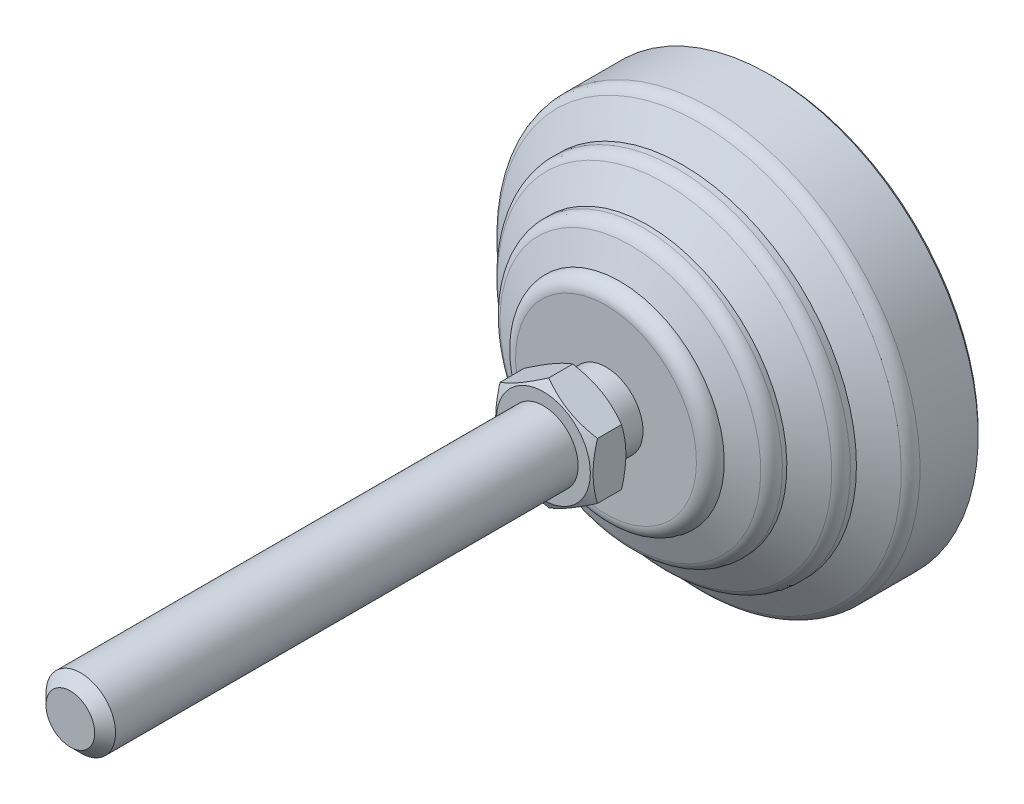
ISO-10303-21;
HEADER;
FILE_DESCRIPTION(('STEP AP214'),'2;1');
FILE_NAME('part.step','',(''),(''),'','','');
FILE_SCHEMA(('AUTOMOTIVE_DESIGN { 1 0 10303 214 1 1 1 1 }'));
ENDSEC;
DATA;
#1=APPLICATION_CONTEXT('core data for automotive mechanical design processes');
#2=APPLICATION_PROTOCOL_DEFINITION('international standard','automotive_design',2000,#1);
#3=PRODUCT_CONTEXT('',#1,'mechanical');
#4=PRODUCT('Part','Part','',(#3));
#5=PRODUCT_RELATED_PRODUCT_CATEGORY('part','',(#4));
#6=PRODUCT_DEFINITION_FORMATION('','',#4);
#7=PRODUCT_DEFINITION_CONTEXT('part definition',#1,'design');
#8=PRODUCT_DEFINITION('design','',#6,#7);
#9=PRODUCT_DEFINITION_SHAPE('','',#8);
#10=(LENGTH_UNIT() NAMED_UNIT(*) SI_UNIT(.MILLI.,.METRE.));
#11=(NAMED_UNIT(*) PLANE_ANGLE_UNIT() SI_UNIT($,.RADIAN.));
#12=(NAMED_UNIT(*) SI_UNIT($,.STERADIAN.) SOLID_ANGLE_UNIT());
#13=UNCERTAINTY_MEASURE_WITH_UNIT(LENGTH_MEASURE(1.E-05),#10,'distance_accuracy_value','');
#14=(GEOMETRIC_REPRESENTATION_CONTEXT(3) GLOBAL_UNCERTAINTY_ASSIGNED_CONTEXT((#13)) GLOBAL_UNIT_ASSIGNED_CONTEXT((#10,
#11,#12)) REPRESENTATION_CONTEXT('',''));
#15=CARTESIAN_POINT('',(0.,0.,0.));
#16=DIRECTION('',(0.,0.,1.));
#17=DIRECTION('',(1.,0.,0.));
#18=AXIS2_PLACEMENT_3D('',#15,#16,#17);
#19=CARTESIAN_POINT('',(-29.5,0.,0.));
#20=DIRECTION('',(0.,0.,1.));
#21=DIRECTION('',(0.,-1.,0.));
#22=AXIS2_PLACEMENT_3D('',#19,#20,#21);
#23=PLANE('',#22);
#24=CARTESIAN_POINT('',(0.,0.,0.));
#25=DIRECTION('',(0.,0.,-1.));
#26=DIRECTION('',(0.,1.,0.));
#27=AXIS2_PLACEMENT_3D('',#24,#25,#26);
#28=CIRCLE('',#27,29.5);
#29=CARTESIAN_POINT('',(0.,29.5,0.));
#30=VERTEX_POINT('',#29);
#31=EDGE_CURVE('E95',#30,#30,#28,.T.);
#32=ORIENTED_EDGE('',*,*,#31,.T.);
#33=EDGE_LOOP('',(#32));
#34=FACE_BOUND('',#33,.T.);
#35=ADVANCED_FACE('F14',(#34),#23,.F.);
#36=CARTESIAN_POINT('',(-5.32445501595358,0.,28.));
#37=DIRECTION('',(0.,0.,1.));
#38=DIRECTION('',(0.,-1.,0.));
#39=AXIS2_PLACEMENT_3D('',#36,#37,#38);
#40=PLANE('',#39);
#41=CARTESIAN_POINT('',(0.,0.,28.));
#42=DIRECTION('',(0.,0.,1.));
#43=DIRECTION('',(1.,0.,0.));
#44=AXIS2_PLACEMENT_3D('',#41,#42,#43);
#45=CIRCLE('',#44,6.75);
#46=CARTESIAN_POINT('',(6.75,0.,28.));
#47=VERTEX_POINT('',#46);
#48=EDGE_CURVE('E542',#47,#47,#45,.T.);
#49=ORIENTED_EDGE('',*,*,#48,.F.);
#50=EDGE_LOOP('',(#49));
#51=FACE_BOUND('',#50,.T.);
#52=CARTESIAN_POINT('',(0.,0.,28.));
#53=DIRECTION('',(0.,0.,-1.));
#54=DIRECTION('',(0.,1.,0.));
#55=AXIS2_PLACEMENT_3D('',#52,#53,#54);
#56=CIRCLE('',#55,5.32445501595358);
#57=CARTESIAN_POINT('',(0.,5.32445501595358,28.));
#58=VERTEX_POINT('',#57);
#59=EDGE_CURVE('E74',#58,#58,#56,.T.);
#60=ORIENTED_EDGE('',*,*,#59,.F.);
#61=EDGE_LOOP('',(#60));
#62=FACE_BOUND('',#61,.T.);
#63=ADVANCED_FACE('F270',(#51,#62),#40,.F.);
#64=CARTESIAN_POINT('',(0.,0.,0.));
#65=DIRECTION('',(0.,0.,-1.));
#66=DIRECTION('',(0.,1.,0.));
#67=AXIS2_PLACEMENT_3D('',#64,#65,#66);
#68=CYLINDRICAL_SURFACE('',#67,5.32445501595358);
#69=CARTESIAN_POINT('',(0.,0.,24.));
#70=DIRECTION('',(0.,0.,-1.));
#71=DIRECTION('',(0.,1.,0.));
#72=AXIS2_PLACEMENT_3D('',#69,#70,#71);
#73=CIRCLE('',#72,5.32445501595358);
#74=CARTESIAN_POINT('',(0.,5.32445501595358,24.));
#75=VERTEX_POINT('',#74);
#76=EDGE_CURVE('E131',#75,#75,#73,.T.);
#77=ORIENTED_EDGE('',*,*,#76,.F.);
#78=EDGE_LOOP('',(#77));
#79=FACE_BOUND('',#78,.T.);
#80=ORIENTED_EDGE('',*,*,#59,.T.);
#81=EDGE_LOOP('',(#80));
#82=FACE_BOUND('',#81,.T.);
#83=ADVANCED_FACE('F266',(#79,#82),#68,.T.);
#84=CARTESIAN_POINT('',(-13.,0.,24.));
#85=DIRECTION('',(0.,0.,-1.));
#86=DIRECTION('',(0.,1.,0.));
#87=AXIS2_PLACEMENT_3D('',#84,#85,#86);
#88=PLANE('',#87);
#89=CARTESIAN_POINT('',(0.,0.,24.));
#90=DIRECTION('',(0.,0.,-1.));
#91=DIRECTION('',(0.,1.,0.));
#92=AXIS2_PLACEMENT_3D('',#89,#90,#91);
#93=CIRCLE('',#92,13.);
#94=CARTESIAN_POINT('',(0.,13.,24.));
#95=VERTEX_POINT('',#94);
#96=EDGE_CURVE('E128',#95,#95,#93,.T.);
#97=ORIENTED_EDGE('',*,*,#96,.F.);
#98=EDGE_LOOP('',(#97));
#99=FACE_BOUND('',#98,.T.);
#100=ORIENTED_EDGE('',*,*,#76,.T.);
#101=EDGE_LOOP('',(#100));
#102=FACE_BOUND('',#101,.T.);
#103=ADVANCED_FACE('F262',(#99,#102),#88,.F.);
#104=CARTESIAN_POINT('',(0.,0.,22.));
#105=DIRECTION('',(0.,0.,-1.));
#106=DIRECTION('',(0.,1.,0.));
#107=AXIS2_PLACEMENT_3D('',#104,#105,#106);
#108=TOROIDAL_SURFACE('',#107,13.,2.);
#109=CARTESIAN_POINT('',(0.,0.,22.));
#110=DIRECTION('',(0.,0.,-1.));
#111=DIRECTION('',(0.,1.,0.));
#112=AXIS2_PLACEMENT_3D('',#109,#110,#111);
#113=CIRCLE('',#112,15.);
#114=CARTESIAN_POINT('',(0.,15.,22.));
#115=VERTEX_POINT('',#114);
#116=EDGE_CURVE('E125',#115,#115,#113,.T.);
#117=ORIENTED_EDGE('',*,*,#116,.F.);
#118=EDGE_LOOP('',(#117));
#119=FACE_BOUND('',#118,.T.);
#120=ORIENTED_EDGE('',*,*,#96,.T.);
#121=EDGE_LOOP('',(#120));
#122=FACE_BOUND('',#121,.T.);
#123=ADVANCED_FACE('F258',(#119,#122),#108,.T.);
#124=CARTESIAN_POINT('',(0.,0.,22.));
#125=DIRECTION('',(0.,0.,-1.));
#126=DIRECTION('',(0.,1.,0.));
#127=AXIS2_PLACEMENT_3D('',#124,#125,#126);
#128=CONICAL_SURFACE('',#127,15.,1.19028994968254);
#129=CARTESIAN_POINT('',(0.,0.,20.5028874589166));
#130=DIRECTION('',(0.,0.,-1.));
#131=DIRECTION('',(0.,1.,0.));
#132=AXIS2_PLACEMENT_3D('',#129,#130,#131);
#133=CIRCLE('',#132,18.7427813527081);
#134=CARTESIAN_POINT('',(0.,18.7427813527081,20.5028874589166));
#135=VERTEX_POINT('',#134);
#136=EDGE_CURVE('E122',#135,#135,#133,.T.);
#137=ORIENTED_EDGE('',*,*,#136,.F.);
#138=EDGE_LOOP('',(#137));
#139=FACE_BOUND('',#138,.T.);
#140=ORIENTED_EDGE('',*,*,#116,.T.);
#141=EDGE_LOOP('',(#140));
#142=FACE_BOUND('',#141,.T.);
#143=ADVANCED_FACE('F254',(#139,#142),#128,.T.);
#144=CARTESIAN_POINT('',(0.,0.,18.6459340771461));
#145=DIRECTION('',(0.,0.,-1.));
#146=DIRECTION('',(0.,1.,0.));
#147=AXIS2_PLACEMENT_3D('',#144,#145,#146);
#148=TOROIDAL_SURFACE('',#147,18.,2.00000000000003);
#149=CARTESIAN_POINT('',(0.,0.,18.645934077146));
#150=DIRECTION('',(0.,0.,-1.));
#151=DIRECTION('',(0.,1.,0.));
#152=AXIS2_PLACEMENT_3D('',#149,#150,#151);
#153=CIRCLE('',#152,20.);
#154=CARTESIAN_POINT('',(0.,20.,18.645934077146));
#155=VERTEX_POINT('',#154);
#156=EDGE_CURVE('E119',#155,#155,#153,.T.);
#157=ORIENTED_EDGE('',*,*,#156,.F.);
#158=EDGE_LOOP('',(#157));
#159=FACE_BOUND('',#158,.T.);
#160=ORIENTED_EDGE('',*,*,#136,.T.);
#161=EDGE_LOOP('',(#160));
#162=FACE_BOUND('',#161,.T.);
#163=ADVANCED_FACE('F250',(#159,#162),#148,.T.);
#164=CARTESIAN_POINT('',(0.,0.,0.));
#165=DIRECTION('',(0.,0.,-1.));
#166=DIRECTION('',(0.,1.,0.));
#167=AXIS2_PLACEMENT_3D('',#164,#165,#166);
#168=CYLINDRICAL_SURFACE('',#167,20.);
#169=CARTESIAN_POINT('',(0.,0.,18.));
#170=DIRECTION('',(0.,0.,-1.));
#171=DIRECTION('',(0.,1.,0.));
#172=AXIS2_PLACEMENT_3D('',#169,#170,#171);
#173=CIRCLE('',#172,20.);
#174=CARTESIAN_POINT('',(0.,20.,18.));
#175=VERTEX_POINT('',#174);
#176=EDGE_CURVE('E116',#175,#175,#173,.T.);
#177=ORIENTED_EDGE('',*,*,#176,.F.);
#178=EDGE_LOOP('',(#177));
#179=FACE_BOUND('',#178,.T.);
#180=ORIENTED_EDGE('',*,*,#156,.T.);
#181=EDGE_LOOP('',(#180));
#182=FACE_BOUND('',#181,.T.);
#183=ADVANCED_FACE('F246',(#179,#182),#168,.T.);
#184=CARTESIAN_POINT('',(0.,0.,18.));
#185=DIRECTION('',(0.,0.,-1.));
#186=DIRECTION('',(0.,1.,0.));
#187=AXIS2_PLACEMENT_3D('',#184,#185,#186);
#188=CONICAL_SURFACE('',#187,20.,1.03037682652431);
#189=CARTESIAN_POINT('',(0.,0.,15.5826050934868));
#190=DIRECTION('',(0.,0.,-1.));
#191=DIRECTION('',(0.,1.,0.));
#192=AXIS2_PLACEMENT_3D('',#189,#190,#191);
#193=CIRCLE('',#192,24.0289915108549);
#194=CARTESIAN_POINT('',(0.,24.0289915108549,15.5826050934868));
#195=VERTEX_POINT('',#194);
#196=EDGE_CURVE('E113',#195,#195,#193,.T.);
#197=ORIENTED_EDGE('',*,*,#196,.F.);
#198=EDGE_LOOP('',(#197));
#199=FACE_BOUND('',#198,.T.);
#200=ORIENTED_EDGE('',*,*,#176,.T.);
#201=EDGE_LOOP('',(#200));
#202=FACE_BOUND('',#201,.T.);
#203=ADVANCED_FACE('F242',(#199,#202),#188,.T.);
#204=CARTESIAN_POINT('',(0.,0.,13.8676192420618));
#205=DIRECTION('',(0.,0.,-1.));
#206=DIRECTION('',(0.,1.,0.));
#207=AXIS2_PLACEMENT_3D('',#204,#205,#206);
#208=TOROIDAL_SURFACE('',#207,23.,2.00000000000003);
#209=CARTESIAN_POINT('',(0.,0.,13.8676192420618));
#210=DIRECTION('',(0.,0.,-1.));
#211=DIRECTION('',(0.,1.,0.));
#212=AXIS2_PLACEMENT_3D('',#209,#210,#211);
#213=CIRCLE('',#212,25.);
#214=CARTESIAN_POINT('',(0.,25.,13.8676192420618));
#215=VERTEX_POINT('',#214);
#216=EDGE_CURVE('E110',#215,#215,#213,.T.);
#217=ORIENTED_EDGE('',*,*,#216,.F.);
#218=EDGE_LOOP('',(#217));
#219=FACE_BOUND('',#218,.T.);
#220=ORIENTED_EDGE('',*,*,#196,.T.);
#221=EDGE_LOOP('',(#220));
#222=FACE_BOUND('',#221,.T.);
#223=ADVANCED_FACE('F238',(#219,#222),#208,.T.);
#224=CARTESIAN_POINT('',(0.,0.,0.));
#225=DIRECTION('',(0.,0.,-1.));
#226=DIRECTION('',(0.,1.,0.));
#227=AXIS2_PLACEMENT_3D('',#224,#225,#226);
#228=CYLINDRICAL_SURFACE('',#227,25.);
#229=CARTESIAN_POINT('',(0.,0.,13.));
#230=DIRECTION('',(0.,0.,-1.));
#231=DIRECTION('',(0.,1.,0.));
#232=AXIS2_PLACEMENT_3D('',#229,#230,#231);
#233=CIRCLE('',#232,25.);
#234=CARTESIAN_POINT('',(0.,25.,13.));
#235=VERTEX_POINT('',#234);
#236=EDGE_CURVE('E107',#235,#235,#233,.T.);
#237=ORIENTED_EDGE('',*,*,#236,.F.);
#238=EDGE_LOOP('',(#237));
#239=FACE_BOUND('',#238,.T.);
#240=ORIENTED_EDGE('',*,*,#216,.T.);
#241=EDGE_LOOP('',(#240));
#242=FACE_BOUND('',#241,.T.);
#243=ADVANCED_FACE('F234',(#239,#242),#228,.T.);
#244=CARTESIAN_POINT('',(0.,0.,13.));
#245=DIRECTION('',(0.,0.,-1.));
#246=DIRECTION('',(0.,1.,0.));
#247=AXIS2_PLACEMENT_3D('',#244,#245,#246);
#248=CONICAL_SURFACE('',#247,25.,1.03037682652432);
#249=CARTESIAN_POINT('',(0.,0.,10.5826050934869));
#250=DIRECTION('',(0.,0.,-1.));
#251=DIRECTION('',(0.,1.,0.));
#252=AXIS2_PLACEMENT_3D('',#249,#250,#251);
#253=CIRCLE('',#252,29.028991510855);
#254=CARTESIAN_POINT('',(0.,29.028991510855,10.5826050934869));
#255=VERTEX_POINT('',#254);
#256=EDGE_CURVE('E104',#255,#255,#253,.T.);
#257=ORIENTED_EDGE('',*,*,#256,.F.);
#258=EDGE_LOOP('',(#257));
#259=FACE_BOUND('',#258,.T.);
#260=ORIENTED_EDGE('',*,*,#236,.T.);
#261=EDGE_LOOP('',(#260));
#262=FACE_BOUND('',#261,.T.);
#263=ADVANCED_FACE('F230',(#259,#262),#248,.T.);
#264=CARTESIAN_POINT('',(0.,0.,8.86761924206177));
#265=DIRECTION('',(0.,0.,-1.));
#266=DIRECTION('',(0.,1.,0.));
#267=AXIS2_PLACEMENT_3D('',#264,#265,#266);
#268=TOROIDAL_SURFACE('',#267,28.,2.00000000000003);
#269=CARTESIAN_POINT('',(0.,0.,8.86761924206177));
#270=DIRECTION('',(0.,0.,-1.));
#271=DIRECTION('',(0.,1.,0.));
#272=AXIS2_PLACEMENT_3D('',#269,#270,#271);
#273=CIRCLE('',#272,30.);
#274=CARTESIAN_POINT('',(0.,30.,8.86761924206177));
#275=VERTEX_POINT('',#274);
#276=EDGE_CURVE('E101',#275,#275,#273,.T.);
#277=ORIENTED_EDGE('',*,*,#276,.F.);
#278=EDGE_LOOP('',(#277));
#279=FACE_BOUND('',#278,.T.);
#280=ORIENTED_EDGE('',*,*,#256,.T.);
#281=EDGE_LOOP('',(#280));
#282=FACE_BOUND('',#281,.T.);
#283=ADVANCED_FACE('F226',(#279,#282),#268,.T.);
#284=CARTESIAN_POINT('',(0.,0.,0.));
#285=DIRECTION('',(0.,0.,-1.));
#286=DIRECTION('',(0.,1.,0.));
#287=AXIS2_PLACEMENT_3D('',#284,#285,#286);
#288=CYLINDRICAL_SURFACE('',#287,30.);
#289=CARTESIAN_POINT('',(0.,0.,0.499999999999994));
#290=DIRECTION('',(0.,0.,-1.));
#291=DIRECTION('',(0.,1.,0.));
#292=AXIS2_PLACEMENT_3D('',#289,#290,#291);
#293=CIRCLE('',#292,30.);
#294=CARTESIAN_POINT('',(0.,30.,0.499999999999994));
#295=VERTEX_POINT('',#294);
#296=EDGE_CURVE('E98',#295,#295,#293,.T.);
#297=ORIENTED_EDGE('',*,*,#296,.F.);
#298=EDGE_LOOP('',(#297));
#299=FACE_BOUND('',#298,.T.);
#300=ORIENTED_EDGE('',*,*,#276,.T.);
#301=EDGE_LOOP('',(#300));
#302=FACE_BOUND('',#301,.T.);
#303=ADVANCED_FACE('F222',(#299,#302),#288,.T.);
#304=CARTESIAN_POINT('',(0.,0.,0.499999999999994));
#305=DIRECTION('',(0.,0.,1.));
#306=DIRECTION('',(0.,-1.,0.));
#307=AXIS2_PLACEMENT_3D('',#304,#305,#306);
#308=CONICAL_SURFACE('',#307,30.,0.785398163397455);
#309=ORIENTED_EDGE('',*,*,#31,.F.);
#310=EDGE_LOOP('',(#309));
#311=FACE_BOUND('',#310,.T.);
#312=ORIENTED_EDGE('',*,*,#296,.T.);
#313=EDGE_LOOP('',(#312));
#314=FACE_BOUND('',#313,.T.);
#315=ADVANCED_FACE('F150',(#311,#314),#308,.T.);
#316=CARTESIAN_POINT('',(0.,0.,28.));
#317=DIRECTION('',(0.,0.,1.));
#318=DIRECTION('',(1.,0.,0.));
#319=AXIS2_PLACEMENT_3D('',#316,#317,#318);
#320=CONICAL_SURFACE('',#319,6.75,1.0471975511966);
#321=CARTESIAN_POINT('',(0.000200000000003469,-8.0830192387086,28.7696190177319));
#322=CARTESIAN_POINT('',(-0.153667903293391,-7.99418356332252,28.7183374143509));
#323=CARTESIAN_POINT('',(-0.308109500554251,-7.90501666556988,28.669383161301));
#324=CARTESIAN_POINT('',(-0.618246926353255,-7.72595873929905,28.5767703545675));
#325=CARTESIAN_POINT('',(-0.773943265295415,-7.63606741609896,28.5331140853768));
#326=CARTESIAN_POINT('',(-1.24352516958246,-7.36495417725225,28.4109491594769));
#327=CARTESIAN_POINT('',(-1.5592643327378,-7.18266208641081,28.3414631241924));
#328=CARTESIAN_POINT('',(-2.03176224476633,-6.90986528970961,28.2599825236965));
#329=CARTESIAN_POINT('',(-2.18710922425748,-6.82017566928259,28.2367710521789));
#330=CARTESIAN_POINT('',(-2.49850511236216,-6.64039116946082,28.1978487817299));
#331=CARTESIAN_POINT('',(-2.6545539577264,-6.55029632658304,28.1821373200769));
#332=CARTESIAN_POINT('',(-2.96692267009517,-6.36995016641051,28.1586154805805));
#333=CARTESIAN_POINT('',(-3.12324202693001,-6.27969914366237,28.1507961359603));
#334=CARTESIAN_POINT('',(-3.43601650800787,-6.09911871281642,28.1432178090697));
#335=CARTESIAN_POINT('',(-3.59247162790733,-6.00878930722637,28.1434585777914));
#336=CARTESIAN_POINT('',(-4.02110687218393,-5.76131663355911,28.155197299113));
#337=CARTESIAN_POINT('',(-4.29314668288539,-5.60425437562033,28.1749033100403));
#338=CARTESIAN_POINT('',(-4.83541944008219,-5.29117305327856,28.2373910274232));
#339=CARTESIAN_POINT('',(-5.10565047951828,-5.13515508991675,28.2801940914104));
#340=CARTESIAN_POINT('',(-5.64901454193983,-4.82144370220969,28.3871892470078));
#341=CARTESIAN_POINT('',(-5.92207900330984,-4.6637898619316,28.4518346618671));
#342=CARTESIAN_POINT('',(-6.46413578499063,-4.35083323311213,28.5985536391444));
#343=CARTESIAN_POINT('',(-6.73313504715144,-4.19552643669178,28.680592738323));
#344=CARTESIAN_POINT('',(-7.0002,-4.04133641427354,28.7696190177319));
#345=B_SPLINE_CURVE_WITH_KNOTS('',3,(#321,#322,#323,#324,#325,#326,#327,#328,#329,#330,#331,
#332,#333,#334,#335,#336,#337,#338,#339,#340,#341,#342,#343,#344),.UNSPECIFIED.,.F.,.F.,(4,2,2,
2,2,2,2,2,2,2,2,4),(0.,0.554727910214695,1.10969417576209,2.2219327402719,2.76443041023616,
3.30688013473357,3.84871284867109,4.39052882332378,5.33376515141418,6.27787517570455,
7.2429241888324,8.20607866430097),.UNSPECIFIED.);
#346=CARTESIAN_POINT('',(0.,-8.08290376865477,28.7695523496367));
#347=VERTEX_POINT('',#346);
#348=CARTESIAN_POINT('',(-7.,-4.04145188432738,28.7695523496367));
#349=VERTEX_POINT('',#348);
#350=EDGE_CURVE('E69',#347,#349,#345,.T.);
#351=ORIENTED_EDGE('',*,*,#350,.T.);
#352=CARTESIAN_POINT('',(-7.,-10.8811850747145,31.5728296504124));
#353=CARTESIAN_POINT('',(-7.,-10.5752348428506,31.4243146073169));
#354=CARTESIAN_POINT('',(-7.,-10.2685850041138,31.2772162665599));
#355=CARTESIAN_POINT('',(-7.,-9.65351414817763,30.9866492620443));
#356=CARTESIAN_POINT('',(-7.,-9.34509286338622,30.8431811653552));
#357=CARTESIAN_POINT('',(-7.,-8.72453023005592,30.5599545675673));
#358=CARTESIAN_POINT('',(-7.,-8.41237778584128,30.4202202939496));
#359=CARTESIAN_POINT('',(-7.,-7.78559905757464,30.1464363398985));
#360=CARTESIAN_POINT('',(-7.,-7.47097289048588,30.0123863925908));
#361=CARTESIAN_POINT('',(-7.,-6.82849438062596,29.7472401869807));
#362=CARTESIAN_POINT('',(-7.,-6.50054387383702,29.6163804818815));
#363=CARTESIAN_POINT('',(-7.,-5.84081623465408,29.3645037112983));
#364=CARTESIAN_POINT('',(-7.,-5.50903867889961,29.2434877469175));
#365=CARTESIAN_POINT('',(-7.,-4.84173790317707,29.0144571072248));
#366=CARTESIAN_POINT('',(-7.,-4.50622373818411,28.9064163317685));
#367=CARTESIAN_POINT('',(-7.,-3.83039457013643,28.7067848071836));
#368=CARTESIAN_POINT('',(-7.,-3.49008110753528,28.6151889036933));
#369=CARTESIAN_POINT('',(-7.,-2.80629723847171,28.453320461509));
#370=CARTESIAN_POINT('',(-7.,-2.46285518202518,28.3829313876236));
#371=CARTESIAN_POINT('',(-7.,-1.94454397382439,28.296287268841));
#372=CARTESIAN_POINT('',(-7.,-1.77123615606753,28.2705612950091));
#373=CARTESIAN_POINT('',(-7.,-1.42375128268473,28.2259266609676));
#374=CARTESIAN_POINT('',(-7.,-1.2495743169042,28.2070173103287));
#375=CARTESIAN_POINT('',(-7.,-0.902870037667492,28.1766309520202));
#376=CARTESIAN_POINT('',(-7.,-0.730351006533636,28.1650598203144));
#377=CARTESIAN_POINT('',(-7.,-0.384978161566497,28.1492247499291));
#378=CARTESIAN_POINT('',(-7.,-0.21212435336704,28.1449606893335));
#379=CARTESIAN_POINT('',(-7.,0.133608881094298,28.1438415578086));
#380=CARTESIAN_POINT('',(-7.,0.306488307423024,28.1469865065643));
#381=CARTESIAN_POINT('',(-7.,0.6519602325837,28.1606081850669));
#382=CARTESIAN_POINT('',(-7.,0.824552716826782,28.1710852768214));
#383=CARTESIAN_POINT('',(-7.,1.23857301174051,28.2047901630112));
#384=CARTESIAN_POINT('',(-7.,1.47972707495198,28.2314539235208));
#385=CARTESIAN_POINT('',(-7.,1.96025069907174,28.2976470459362));
#386=CARTESIAN_POINT('',(-7.,2.19962001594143,28.3371781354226));
#387=CARTESIAN_POINT('',(-7.,2.91477396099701,28.4729767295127));
#388=CARTESIAN_POINT('',(-7.,3.38733962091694,28.5864251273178));
#389=CARTESIAN_POINT('',(-7.,4.09399085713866,28.783230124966));
#390=CARTESIAN_POINT('',(-7.,4.33173965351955,28.8541906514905));
#391=CARTESIAN_POINT('',(-7.,4.80492823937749,29.0035010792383));
#392=CARTESIAN_POINT('',(-7.,5.04036801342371,29.0818510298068));
#393=CARTESIAN_POINT('',(-7.,5.5090122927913,29.2446815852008));
#394=CARTESIAN_POINT('',(-7.,5.7422175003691,29.3291601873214));
#395=CARTESIAN_POINT('',(-7.,6.20669435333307,29.5032521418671));
#396=CARTESIAN_POINT('',(-7.,6.43796602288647,29.5928654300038));
#397=CARTESIAN_POINT('',(-7.,6.98976242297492,29.8126009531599));
#398=CARTESIAN_POINT('',(-7.,7.30947896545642,29.9447491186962));
#399=CARTESIAN_POINT('',(-7.,7.94614295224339,30.2155750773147));
#400=CARTESIAN_POINT('',(-7.,8.26309021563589,30.3542532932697));
#401=CARTESIAN_POINT('',(-7.,8.89473420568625,30.6368083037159));
#402=CARTESIAN_POINT('',(-7.,9.20943043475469,30.7806862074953));
#403=CARTESIAN_POINT('',(-7.,9.83689953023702,31.0725841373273));
#404=CARTESIAN_POINT('',(-7.,10.1496723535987,31.2206042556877));
#405=CARTESIAN_POINT('',(-7.,10.7739555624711,31.5201617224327));
#406=CARTESIAN_POINT('',(-7.,11.0854641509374,31.6717028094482));
#407=CARTESIAN_POINT('',(-7.,11.7071281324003,31.9775381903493));
#408=CARTESIAN_POINT('',(-7.,12.0172835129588,32.1318325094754));
#409=CARTESIAN_POINT('',(-7.,12.945960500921,32.5980598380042));
#410=CARTESIAN_POINT('',(-7.,13.5627813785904,32.9133800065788));
#411=CARTESIAN_POINT('',(-7.,14.740395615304,33.5230359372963));
#412=CARTESIAN_POINT('',(-7.,15.3014586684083,33.8168531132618));
#413=CARTESIAN_POINT('',(-7.,16.4215094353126,34.4084645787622));
#414=CARTESIAN_POINT('',(-7.,16.9804970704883,34.7062590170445));
#415=CARTESIAN_POINT('',(-7.,18.095415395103,35.3040962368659));
#416=CARTESIAN_POINT('',(-7.,18.651350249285,35.6041312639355));
#417=CARTESIAN_POINT('',(-7.,19.7618967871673,36.2065657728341));
#418=CARTESIAN_POINT('',(-7.,20.3165085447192,36.5089651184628));
#419=CARTESIAN_POINT('',(-7.,20.8706352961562,36.8122446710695));
#420=B_SPLINE_CURVE_WITH_KNOTS('',3,(#352,#353,#354,#355,#356,#357,#358,#359,#360,#361,#362,
#363,#364,#365,#366,#367,#368,#369,#370,#371,#372,#373,#374,#375,#376,#377,#378,#379,#380,#381,
#382,#383,#384,#385,#386,#387,#388,#389,#390,#391,#392,#393,#394,#395,#396,#397,#398,#399,#400,
#401,#402,#403,#404,#405,#406,#407,#408,#409,#410,#411,#412,#413,#414,#415,#416,#417,#418,#419),
.UNSPECIFIED.,.F.,.F.,(4,2,2,2,2,2,2,2,2,2,2,2,2,2,2,2,2,2,2,2,2,2,2,2,2,2,2,2,2,2,2,2,2,4),(0.,
1.02028698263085,2.04073236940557,3.06669051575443,4.09260044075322,5.15176160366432,
6.21104108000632,7.26815275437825,8.32493251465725,9.37579447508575,9.90130195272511,
10.4267561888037,10.945326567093,11.4638882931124,11.9824513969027,12.5010401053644,
13.2285005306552,13.956058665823,15.4119696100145,16.1562450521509,16.9005254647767,
17.6445637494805,18.3885927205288,19.4263457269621,20.4641660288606,21.5022090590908,
22.5402752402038,23.5794991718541,24.6187326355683,26.696904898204,28.5969096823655,
30.4969857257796,32.3921738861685,34.2872536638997),.UNSPECIFIED.);
#421=CARTESIAN_POINT('',(-7.,4.04145188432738,28.7695523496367));
#422=VERTEX_POINT('',#421);
#423=EDGE_CURVE('E80',#349,#422,#420,.T.);
#424=ORIENTED_EDGE('',*,*,#423,.T.);
#425=CARTESIAN_POINT('',(-7.0002,4.04133641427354,28.7696190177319));
#426=CARTESIAN_POINT('',(-6.84633209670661,4.13017208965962,28.7183374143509));
#427=CARTESIAN_POINT('',(-6.69189049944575,4.21933898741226,28.669383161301));
#428=CARTESIAN_POINT('',(-6.38175307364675,4.39839691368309,28.5767703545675));
#429=CARTESIAN_POINT('',(-6.22605673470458,4.48828823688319,28.5331140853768));
#430=CARTESIAN_POINT('',(-5.75647483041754,4.75940147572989,28.4109491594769));
#431=CARTESIAN_POINT('',(-5.4407356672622,4.94169356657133,28.3414631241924));
#432=CARTESIAN_POINT('',(-4.96823775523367,5.21449036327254,28.2599825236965));
#433=CARTESIAN_POINT('',(-4.81289077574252,5.30417998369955,28.2367710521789));
#434=CARTESIAN_POINT('',(-4.50149488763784,5.48396448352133,28.1978487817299));
#435=CARTESIAN_POINT('',(-4.34544604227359,5.57405932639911,28.1821373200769));
#436=CARTESIAN_POINT('',(-4.03307732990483,5.75440548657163,28.1586154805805));
#437=CARTESIAN_POINT('',(-3.87675797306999,5.84465650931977,28.1507961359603));
#438=CARTESIAN_POINT('',(-3.56398349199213,6.02523694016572,28.1432178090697));
#439=CARTESIAN_POINT('',(-3.40752837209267,6.11556634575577,28.1434585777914));
#440=CARTESIAN_POINT('',(-2.97889312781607,6.36303901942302,28.155197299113));
#441=CARTESIAN_POINT('',(-2.7068533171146,6.52010127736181,28.1749033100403));
#442=CARTESIAN_POINT('',(-2.16458055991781,6.83318259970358,28.2373910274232));
#443=CARTESIAN_POINT('',(-1.89434952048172,6.9892005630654,28.2801940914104));
#444=CARTESIAN_POINT('',(-1.35098545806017,7.30291195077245,28.3871892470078));
#445=CARTESIAN_POINT('',(-1.07792099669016,7.46056579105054,28.4518346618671));
#446=CARTESIAN_POINT('',(-0.535864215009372,7.77352241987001,28.5985536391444));
#447=CARTESIAN_POINT('',(-0.266864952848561,7.92882921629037,28.680592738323));
#448=CARTESIAN_POINT('',(0.000199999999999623,8.0830192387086,28.7696190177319));
#449=B_SPLINE_CURVE_WITH_KNOTS('',3,(#425,#426,#427,#428,#429,#430,#431,#432,#433,#434,#435,
#436,#437,#438,#439,#440,#441,#442,#443,#444,#445,#446,#447,#448),.UNSPECIFIED.,.F.,.F.,(4,2,2,
2,2,2,2,2,2,2,2,4),(0.,0.554727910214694,1.10969417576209,2.2219327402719,2.76443041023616,
3.30688013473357,3.84871284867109,4.39052882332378,5.33376515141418,6.27787517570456,
7.2429241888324,8.20607866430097),.UNSPECIFIED.);
#450=CARTESIAN_POINT('',(0.,8.08290376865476,28.7695523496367));
#451=VERTEX_POINT('',#450);
#452=EDGE_CURVE('E174',#422,#451,#449,.T.);
#453=ORIENTED_EDGE('',*,*,#452,.T.);
#454=CARTESIAN_POINT('',(-0.000200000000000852,8.0830192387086,28.7696190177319));
#455=CARTESIAN_POINT('',(0.15366790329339,7.99418356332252,28.7183374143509));
#456=CARTESIAN_POINT('',(0.308109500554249,7.90501666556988,28.669383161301));
#457=CARTESIAN_POINT('',(0.618246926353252,7.72595873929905,28.5767703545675));
#458=CARTESIAN_POINT('',(0.773943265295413,7.63606741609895,28.5331140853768));
#459=CARTESIAN_POINT('',(1.24352516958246,7.36495417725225,28.4109491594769));
#460=CARTESIAN_POINT('',(1.5592643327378,7.18266208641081,28.3414631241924));
#461=CARTESIAN_POINT('',(2.03176224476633,6.9098652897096,28.2599825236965));
#462=CARTESIAN_POINT('',(2.18710922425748,6.82017566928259,28.2367710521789));
#463=CARTESIAN_POINT('',(2.49850511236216,6.64039116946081,28.1978487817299));
#464=CARTESIAN_POINT('',(2.65455395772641,6.55029632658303,28.1821373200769));
#465=CARTESIAN_POINT('',(2.96692267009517,6.36995016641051,28.1586154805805));
#466=CARTESIAN_POINT('',(3.12324202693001,6.27969914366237,28.1507961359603));
#467=CARTESIAN_POINT('',(3.43601650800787,6.09911871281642,28.1432178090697));
#468=CARTESIAN_POINT('',(3.59247162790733,6.00878930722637,28.1434585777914));
#469=CARTESIAN_POINT('',(4.02110687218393,5.76131663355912,28.155197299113));
#470=CARTESIAN_POINT('',(4.2931466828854,5.60425437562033,28.1749033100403));
#471=CARTESIAN_POINT('',(4.83541944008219,5.29117305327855,28.2373910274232));
#472=CARTESIAN_POINT('',(5.10565047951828,5.13515508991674,28.2801940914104));
#473=CARTESIAN_POINT('',(5.64901454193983,4.82144370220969,28.3871892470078));
#474=CARTESIAN_POINT('',(5.92207900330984,4.66378986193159,28.4518346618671));
#475=CARTESIAN_POINT('',(6.46413578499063,4.35083323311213,28.5985536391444));
#476=CARTESIAN_POINT('',(6.73313504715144,4.19552643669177,28.680592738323));
#477=CARTESIAN_POINT('',(7.0002,4.04133641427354,28.7696190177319));
#478=B_SPLINE_CURVE_WITH_KNOTS('',3,(#454,#455,#456,#457,#458,#459,#460,#461,#462,#463,#464,
#465,#466,#467,#468,#469,#470,#471,#472,#473,#474,#475,#476,#477),.UNSPECIFIED.,.F.,.F.,(4,2,2,
2,2,2,2,2,2,2,2,4),(0.,0.554727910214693,1.10969417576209,2.2219327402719,2.76443041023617,
3.30688013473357,3.8487128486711,4.39052882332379,5.33376515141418,6.27787517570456,
7.2429241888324,8.20607866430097),.UNSPECIFIED.);
#479=CARTESIAN_POINT('',(7.,4.04145188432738,28.7695523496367));
#480=VERTEX_POINT('',#479);
#481=EDGE_CURVE('E167',#451,#480,#478,.T.);
#482=ORIENTED_EDGE('',*,*,#481,.T.);
#483=CARTESIAN_POINT('',(7.,-10.8811850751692,31.5728296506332));
#484=CARTESIAN_POINT('',(7.,-10.57523484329,31.4243146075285));
#485=CARTESIAN_POINT('',(7.,-10.268585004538,31.2772162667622));
#486=CARTESIAN_POINT('',(7.,-9.65351414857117,30.9866492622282));
#487=CARTESIAN_POINT('',(7.,-9.34509286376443,30.8431811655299));
#488=CARTESIAN_POINT('',(7.,-8.72453023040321,30.5599545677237));
#489=CARTESIAN_POINT('',(7.,-8.41237778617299,30.4202202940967));
#490=CARTESIAN_POINT('',(7.,-7.78559905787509,30.1464363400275));
#491=CARTESIAN_POINT('',(7.,-7.47097289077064,30.0123863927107));
#492=CARTESIAN_POINT('',(7.,-6.82849438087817,29.7472401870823));
#493=CARTESIAN_POINT('',(7.,-6.50054387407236,29.6163804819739));
#494=CARTESIAN_POINT('',(7.,-5.84081623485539,29.3645037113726));
#495=CARTESIAN_POINT('',(7.,-5.50903867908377,29.2434877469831));
#496=CARTESIAN_POINT('',(7.,-4.84173790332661,29.0144571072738));
#497=CARTESIAN_POINT('',(7.,-4.50622373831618,28.9064163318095));
#498=CARTESIAN_POINT('',(7.,-3.83039457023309,28.7067848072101));
#499=CARTESIAN_POINT('',(7.,-3.490081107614,28.6151889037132));
#500=CARTESIAN_POINT('',(7.,-2.80629723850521,28.4533204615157));
#501=CARTESIAN_POINT('',(7.,-2.46285518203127,28.3829313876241));
#502=CARTESIAN_POINT('',(7.,-1.9445439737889,28.2962872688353));
#503=CARTESIAN_POINT('',(7.,-1.7712361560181,28.270561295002));
#504=CARTESIAN_POINT('',(7.,-1.42375128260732,28.2259266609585));
#505=CARTESIAN_POINT('',(7.,-1.24957431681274,28.2070173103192));
#506=CARTESIAN_POINT('',(7.,-0.902870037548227,28.1766309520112));
#507=CARTESIAN_POINT('',(7.,-0.730351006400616,28.1650598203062));
#508=CARTESIAN_POINT('',(7.,-0.384978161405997,28.1492247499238));
#509=CARTESIAN_POINT('',(7.,-0.212124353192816,28.1449606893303));
#510=CARTESIAN_POINT('',(7.,0.133608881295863,28.1438415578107));
#511=CARTESIAN_POINT('',(7.,0.306488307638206,28.1469865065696));
#512=CARTESIAN_POINT('',(7.,0.651960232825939,28.1606081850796));
#513=CARTESIAN_POINT('',(7.,0.824552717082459,28.1710852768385));
#514=CARTESIAN_POINT('',(7.,1.23857301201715,28.2047901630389));
#515=CARTESIAN_POINT('',(7.,1.47972707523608,28.2314539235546));
#516=CARTESIAN_POINT('',(7.,1.96025069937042,28.2976470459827));
#517=CARTESIAN_POINT('',(7.,2.19962001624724,28.3371781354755));
#518=CARTESIAN_POINT('',(7.,2.91477396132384,28.4729767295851));
#519=CARTESIAN_POINT('',(7.,3.38733962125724,28.5864251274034));
#520=CARTESIAN_POINT('',(7.,4.09399085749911,28.783230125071));
#521=CARTESIAN_POINT('',(7.,4.33173965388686,28.8541906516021));
#522=CARTESIAN_POINT('',(7.,4.80492823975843,29.0035010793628));
#523=CARTESIAN_POINT('',(7.,5.04036801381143,29.0818510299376));
#524=CARTESIAN_POINT('',(7.,5.50901229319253,29.2446815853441));
#525=CARTESIAN_POINT('',(7.,5.74221750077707,29.3291601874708));
#526=CARTESIAN_POINT('',(7.,6.2066943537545,29.5032521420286));
#527=CARTESIAN_POINT('',(7.,6.43796602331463,29.5928654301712));
#528=CARTESIAN_POINT('',(7.,6.98976242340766,29.8126009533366));
#529=CARTESIAN_POINT('',(7.,7.30947896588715,29.9447491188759));
#530=CARTESIAN_POINT('',(7.,7.94614295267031,30.2155750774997));
#531=CARTESIAN_POINT('',(7.,8.26309021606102,30.3542532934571));
#532=CARTESIAN_POINT('',(7.,8.89473420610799,30.6368083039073));
#533=CARTESIAN_POINT('',(7.,9.20943043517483,30.7806862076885));
#534=CARTESIAN_POINT('',(7.,9.83689953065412,31.0725841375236));
#535=CARTESIAN_POINT('',(7.,10.1496723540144,31.2206042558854));
#536=CARTESIAN_POINT('',(7.,10.773955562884,31.5201617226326));
#537=CARTESIAN_POINT('',(7.,11.0854641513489,31.6717028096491));
#538=CARTESIAN_POINT('',(7.,11.7071281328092,31.977538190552));
#539=CARTESIAN_POINT('',(7.,12.0172835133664,32.1318325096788));
#540=CARTESIAN_POINT('',(7.,12.9459605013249,32.5980598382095));
#541=CARTESIAN_POINT('',(7.,13.5627813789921,32.9133800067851));
#542=CARTESIAN_POINT('',(7.,14.7403956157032,33.5230359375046));
#543=CARTESIAN_POINT('',(7.,15.3014586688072,33.8168531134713));
#544=CARTESIAN_POINT('',(7.,16.421509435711,34.4084645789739));
#545=CARTESIAN_POINT('',(7.,16.9804970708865,34.7062590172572));
#546=CARTESIAN_POINT('',(7.,18.0954153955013,35.3040962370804));
#547=CARTESIAN_POINT('',(7.,18.6513502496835,35.6041312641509));
#548=CARTESIAN_POINT('',(7.,19.7618967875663,36.2065657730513));
#549=CARTESIAN_POINT('',(7.,20.3165085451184,36.5089651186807));
#550=CARTESIAN_POINT('',(7.,20.8706352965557,36.8122446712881));
#551=B_SPLINE_CURVE_WITH_KNOTS('',3,(#483,#484,#485,#486,#487,#488,#489,#490,#491,#492,#493,
#494,#495,#496,#497,#498,#499,#500,#501,#502,#503,#504,#505,#506,#507,#508,#509,#510,#511,#512,
#513,#514,#515,#516,#517,#518,#519,#520,#521,#522,#523,#524,#525,#526,#527,#528,#529,#530,#531,
#532,#533,#534,#535,#536,#537,#538,#539,#540,#541,#542,#543,#544,#545,#546,#547,#548,#549,#550),
.UNSPECIFIED.,.F.,.F.,(4,2,2,2,2,2,2,2,2,2,2,2,2,2,2,2,2,2,2,2,2,2,2,2,2,2,2,2,2,2,2,2,2,4),(0.,
1.02028698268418,2.04073236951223,3.06669051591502,4.09260044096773,5.15176160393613,
6.21104108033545,7.2681527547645,8.32493251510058,9.37579447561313,9.90130195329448,
10.4267561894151,10.9453265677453,11.4638882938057,11.982451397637,12.5010401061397,
13.2285005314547,13.9560586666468,15.4119696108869,16.1562450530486,16.9005254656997,
17.6445637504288,18.3885927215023,19.4263457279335,20.4641660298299,21.5022090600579,
22.5402752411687,23.5794991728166,24.6187326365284,26.6969048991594,28.5969096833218,
30.4969857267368,32.3921738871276,34.2872536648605),.UNSPECIFIED.);
#552=CARTESIAN_POINT('',(7.,-4.04145188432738,28.7695523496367));
#553=VERTEX_POINT('',#552);
#554=EDGE_CURVE('E29',#480,#553,#551,.F.);
#555=ORIENTED_EDGE('',*,*,#554,.T.);
#556=CARTESIAN_POINT('',(7.0002,-4.04133641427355,28.7696190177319));
#557=CARTESIAN_POINT('',(6.84633209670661,-4.13017208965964,28.7183374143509));
#558=CARTESIAN_POINT('',(6.69189049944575,-4.21933898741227,28.669383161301));
#559=CARTESIAN_POINT('',(6.38175307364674,-4.3983969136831,28.5767703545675));
#560=CARTESIAN_POINT('',(6.22605673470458,-4.4882882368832,28.5331140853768));
#561=CARTESIAN_POINT('',(5.75647483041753,-4.7594014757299,28.4109491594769));
#562=CARTESIAN_POINT('',(5.4407356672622,-4.94169356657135,28.3414631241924));
#563=CARTESIAN_POINT('',(4.96823775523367,-5.21449036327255,28.2599825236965));
#564=CARTESIAN_POINT('',(4.81289077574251,-5.30417998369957,28.2367710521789));
#565=CARTESIAN_POINT('',(4.50149488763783,-5.48396448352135,28.1978487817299));
#566=CARTESIAN_POINT('',(4.34544604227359,-5.57405932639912,28.1821373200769));
#567=CARTESIAN_POINT('',(4.03307732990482,-5.75440548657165,28.1586154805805));
#568=CARTESIAN_POINT('',(3.87675797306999,-5.84465650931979,28.1507961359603));
#569=CARTESIAN_POINT('',(3.56398349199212,-6.02523694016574,28.1432178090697));
#570=CARTESIAN_POINT('',(3.40752837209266,-6.11556634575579,28.1434585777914));
#571=CARTESIAN_POINT('',(2.97889312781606,-6.36303901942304,28.155197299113));
#572=CARTESIAN_POINT('',(2.7068533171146,-6.52010127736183,28.1749033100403));
#573=CARTESIAN_POINT('',(2.1645805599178,-6.8331825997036,28.2373910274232));
#574=CARTESIAN_POINT('',(1.89434952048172,-6.98920056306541,28.2801940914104));
#575=CARTESIAN_POINT('',(1.35098545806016,-7.30291195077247,28.3871892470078));
#576=CARTESIAN_POINT('',(1.07792099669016,-7.46056579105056,28.4518346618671));
#577=CARTESIAN_POINT('',(0.535864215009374,-7.77352241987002,28.5985536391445));
#578=CARTESIAN_POINT('',(0.266864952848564,-7.92882921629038,28.680592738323));
#579=CARTESIAN_POINT('',(-0.000199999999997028,-8.08301923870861,28.7696190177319));
#580=B_SPLINE_CURVE_WITH_KNOTS('',3,(#556,#557,#558,#559,#560,#561,#562,#563,#564,#565,#566,
#567,#568,#569,#570,#571,#572,#573,#574,#575,#576,#577,#578,#579),.UNSPECIFIED.,.F.,.F.,(4,2,2,
2,2,2,2,2,2,2,2,4),(0.,0.554727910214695,1.10969417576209,2.2219327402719,2.76443041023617,
3.30688013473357,3.8487128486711,4.39052882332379,5.33376515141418,6.27787517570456,
7.24292418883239,8.20607866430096),.UNSPECIFIED.);
#581=EDGE_CURVE('E66',#553,#347,#580,.T.);
#582=ORIENTED_EDGE('',*,*,#581,.T.);
#583=EDGE_LOOP('',(#351,#424,#453,#482,#555,#582));
#584=FACE_BOUND('',#583,.T.);
#585=ORIENTED_EDGE('',*,*,#48,.T.);
#586=EDGE_LOOP('',(#585));
#587=FACE_BOUND('',#586,.T.);
#588=ADVANCED_FACE('F67',(#584,#587),#320,.T.);
#589=CARTESIAN_POINT('',(-4.82445501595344,0.,33.));
#590=DIRECTION('',(0.,0.,-1.));
#591=DIRECTION('',(0.,1.,0.));
#592=AXIS2_PLACEMENT_3D('',#589,#590,#591);
#593=PLANE('',#592);
#594=CARTESIAN_POINT('',(0.,0.,33.));
#595=DIRECTION('',(0.,0.,-1.));
#596=DIRECTION('',(-1.,0.,0.));
#597=AXIS2_PLACEMENT_3D('',#594,#595,#596);
#598=CIRCLE('',#597,5.);
#599=CARTESIAN_POINT('',(-5.,0.,33.));
#600=VERTEX_POINT('',#599);
#601=EDGE_CURVE('E73',#600,#600,#598,.F.);
#602=ORIENTED_EDGE('',*,*,#601,.F.);
#603=EDGE_LOOP('',(#602));
#604=FACE_BOUND('',#603,.T.);
#605=CARTESIAN_POINT('',(0.,0.,33.));
#606=DIRECTION('',(0.,0.,1.));
#607=DIRECTION('',(1.,0.,0.));
#608=AXIS2_PLACEMENT_3D('',#605,#606,#607);
#609=CIRCLE('',#608,6.75);
#610=CARTESIAN_POINT('',(6.75,0.,33.));
#611=VERTEX_POINT('',#610);
#612=EDGE_CURVE('E79',#611,#611,#609,.T.);
#613=ORIENTED_EDGE('',*,*,#612,.T.);
#614=EDGE_LOOP('',(#613));
#615=FACE_BOUND('',#614,.T.);
#616=ADVANCED_FACE('F149',(#604,#615),#593,.F.);
#617=CARTESIAN_POINT('',(0.,0.,30.919497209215));
#618=DIRECTION('',(0.,0.,-1.));
#619=DIRECTION('',(-1.,0.,0.));
#620=AXIS2_PLACEMENT_3D('',#617,#618,#619);
#621=CONICAL_SURFACE('',#620,10.3535365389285,1.0471975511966);
#622=CARTESIAN_POINT('',(-7.0002,-4.04133641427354,32.2303809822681));
#623=CARTESIAN_POINT('',(-6.84633209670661,-4.13017208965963,32.2816625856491));
#624=CARTESIAN_POINT('',(-6.69189049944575,-4.21933898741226,32.330616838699));
#625=CARTESIAN_POINT('',(-6.38175307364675,-4.39839691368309,32.4232296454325));
#626=CARTESIAN_POINT('',(-6.22605673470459,-4.48828823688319,32.4668859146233));
#627=CARTESIAN_POINT('',(-5.75647483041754,-4.75940147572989,32.5890508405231));
#628=CARTESIAN_POINT('',(-5.4407356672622,-4.94169356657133,32.6585368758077));
#629=CARTESIAN_POINT('',(-4.96823775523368,-5.21449036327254,32.7400174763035));
#630=CARTESIAN_POINT('',(-4.81289077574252,-5.30417998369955,32.7632289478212));
#631=CARTESIAN_POINT('',(-4.50149488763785,-5.48396448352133,32.8021512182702));
#632=CARTESIAN_POINT('',(-4.3454460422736,-5.57405932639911,32.8178626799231));
#633=CARTESIAN_POINT('',(-4.03307732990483,-5.75440548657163,32.8413845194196));
#634=CARTESIAN_POINT('',(-3.87675797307,-5.84465650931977,32.8492038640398));
#635=CARTESIAN_POINT('',(-3.56398349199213,-6.02523694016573,32.8567821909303));
#636=CARTESIAN_POINT('',(-3.40752837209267,-6.11556634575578,32.8565414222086));
#637=CARTESIAN_POINT('',(-2.97889312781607,-6.36303901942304,32.844802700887));
#638=CARTESIAN_POINT('',(-2.7068533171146,-6.52010127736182,32.8250966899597));
#639=CARTESIAN_POINT('',(-2.1645805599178,-6.83318259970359,32.7626089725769));
#640=CARTESIAN_POINT('',(-1.89434952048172,-6.98920056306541,32.7198059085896));
#641=CARTESIAN_POINT('',(-1.35098545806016,-7.30291195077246,32.6128107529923));
#642=CARTESIAN_POINT('',(-1.07792099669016,-7.46056579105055,32.548165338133));
#643=CARTESIAN_POINT('',(-0.535864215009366,-7.77352241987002,32.4014463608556));
#644=CARTESIAN_POINT('',(-0.266864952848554,-7.92882921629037,32.3194072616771));
#645=CARTESIAN_POINT('',(0.000200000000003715,-8.0830192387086,32.2303809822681));
#646=B_SPLINE_CURVE_WITH_KNOTS('',3,(#622,#623,#624,#625,#626,#627,#628,#629,#630,#631,#632,
#633,#634,#635,#636,#637,#638,#639,#640,#641,#642,#643,#644,#645),.UNSPECIFIED.,.F.,.F.,(4,2,2,
2,2,2,2,2,2,2,2,4),(0.,0.554727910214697,1.1096941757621,2.2219327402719,2.76443041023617,
3.30688013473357,3.8487128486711,4.39052882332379,5.33376515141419,6.27787517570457,
7.24292418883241,8.20607866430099),.UNSPECIFIED.);
#647=CARTESIAN_POINT('',(-7.,-4.04145188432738,32.2304476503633));
#648=VERTEX_POINT('',#647);
#649=CARTESIAN_POINT('',(0.,-8.08290376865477,32.2304476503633));
#650=VERTEX_POINT('',#649);
#651=EDGE_CURVE('E87',#648,#650,#646,.T.);
#652=ORIENTED_EDGE('',*,*,#651,.T.);
#653=CARTESIAN_POINT('',(-0.000199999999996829,-8.08301923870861,32.2303809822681));
#654=CARTESIAN_POINT('',(0.153667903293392,-7.99418356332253,32.2816625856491));
#655=CARTESIAN_POINT('',(0.308109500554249,-7.9050166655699,32.330616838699));
#656=CARTESIAN_POINT('',(0.618246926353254,-7.72595873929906,32.4232296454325));
#657=CARTESIAN_POINT('',(0.773943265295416,-7.63606741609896,32.4668859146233));
#658=CARTESIAN_POINT('',(1.24352516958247,-7.36495417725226,32.5890508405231));
#659=CARTESIAN_POINT('',(1.5592643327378,-7.18266208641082,32.6585368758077));
#660=CARTESIAN_POINT('',(2.03176224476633,-6.90986528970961,32.7400174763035));
#661=CARTESIAN_POINT('',(2.18710922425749,-6.8201756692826,32.7632289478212));
#662=CARTESIAN_POINT('',(2.49850511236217,-6.64039116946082,32.8021512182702));
#663=CARTESIAN_POINT('',(2.65455395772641,-6.55029632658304,32.8178626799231));
#664=CARTESIAN_POINT('',(2.96692267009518,-6.36995016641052,32.8413845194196));
#665=CARTESIAN_POINT('',(3.12324202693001,-6.27969914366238,32.8492038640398));
#666=CARTESIAN_POINT('',(3.43601650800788,-6.09911871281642,32.8567821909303));
#667=CARTESIAN_POINT('',(3.59247162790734,-6.00878930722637,32.8565414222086));
#668=CARTESIAN_POINT('',(4.02110687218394,-5.76131663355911,32.844802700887));
#669=CARTESIAN_POINT('',(4.29314668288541,-5.60425437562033,32.8250966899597));
#670=CARTESIAN_POINT('',(4.83541944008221,-5.29117305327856,32.7626089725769));
#671=CARTESIAN_POINT('',(5.10565047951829,-5.13515508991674,32.7198059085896));
#672=CARTESIAN_POINT('',(5.64901454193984,-4.82144370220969,32.6128107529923));
#673=CARTESIAN_POINT('',(5.92207900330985,-4.6637898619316,32.548165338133));
#674=CARTESIAN_POINT('',(6.46413578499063,-4.35083323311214,32.4014463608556));
#675=CARTESIAN_POINT('',(6.73313504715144,-4.19552643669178,32.3194072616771));
#676=CARTESIAN_POINT('',(7.0002,-4.04133641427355,32.2303809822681));
#677=B_SPLINE_CURVE_WITH_KNOTS('',3,(#653,#654,#655,#656,#657,#658,#659,#660,#661,#662,#663,
#664,#665,#666,#667,#668,#669,#670,#671,#672,#673,#674,#675,#676),.UNSPECIFIED.,.F.,.F.,(4,2,2,
2,2,2,2,2,2,2,2,4),(0.,0.554727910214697,1.1096941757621,2.22193274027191,2.76443041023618,
3.30688013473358,3.84871284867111,4.3905288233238,5.3337651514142,6.27787517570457,
7.24292418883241,8.20607866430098),.UNSPECIFIED.);
#678=CARTESIAN_POINT('',(7.,-4.04145188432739,32.2304476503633));
#679=VERTEX_POINT('',#678);
#680=EDGE_CURVE('E85',#650,#679,#677,.T.);
#681=ORIENTED_EDGE('',*,*,#680,.T.);
#682=CARTESIAN_POINT('',(7.,-10.8811850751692,29.4271703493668));
#683=CARTESIAN_POINT('',(7.,-10.57523484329,29.5756853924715));
#684=CARTESIAN_POINT('',(7.,-10.268585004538,29.7227837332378));
#685=CARTESIAN_POINT('',(7.,-9.65351414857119,30.0133507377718));
#686=CARTESIAN_POINT('',(7.,-9.34509286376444,30.1568188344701));
#687=CARTESIAN_POINT('',(7.,-8.72453023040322,30.4400454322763));
#688=CARTESIAN_POINT('',(7.,-8.412377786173,30.5797797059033));
#689=CARTESIAN_POINT('',(7.,-7.7855990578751,30.8535636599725));
#690=CARTESIAN_POINT('',(7.,-7.47097289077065,30.9876136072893));
#691=CARTESIAN_POINT('',(7.,-6.82849438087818,31.2527598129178));
#692=CARTESIAN_POINT('',(7.,-6.50054387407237,31.3836195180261));
#693=CARTESIAN_POINT('',(7.,-5.8408162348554,31.6354962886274));
#694=CARTESIAN_POINT('',(7.,-5.50903867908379,31.7565122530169));
#695=CARTESIAN_POINT('',(7.,-4.84173790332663,31.9855428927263));
#696=CARTESIAN_POINT('',(7.,-4.5062237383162,32.0935836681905));
#697=CARTESIAN_POINT('',(7.,-3.8303945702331,32.2932151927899));
#698=CARTESIAN_POINT('',(7.,-3.490081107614,32.3848110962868));
#699=CARTESIAN_POINT('',(7.,-2.80629723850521,32.5466795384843));
#700=CARTESIAN_POINT('',(7.,-2.46285518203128,32.617068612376));
#701=CARTESIAN_POINT('',(7.,-1.9445439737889,32.7037127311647));
#702=CARTESIAN_POINT('',(7.,-1.7712361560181,32.7294387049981));
#703=CARTESIAN_POINT('',(7.,-1.42375128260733,32.7740733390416));
#704=CARTESIAN_POINT('',(7.,-1.24957431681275,32.7929826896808));
#705=CARTESIAN_POINT('',(7.,-0.902870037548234,32.8233690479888));
#706=CARTESIAN_POINT('',(7.,-0.730351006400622,32.8349401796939));
#707=CARTESIAN_POINT('',(7.,-0.384978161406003,32.8507752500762));
#708=CARTESIAN_POINT('',(7.,-0.212124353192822,32.8550393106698));
#709=CARTESIAN_POINT('',(7.,0.133608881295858,32.8561584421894));
#710=CARTESIAN_POINT('',(7.,0.306488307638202,32.8530134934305));
#711=CARTESIAN_POINT('',(7.,0.651960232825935,32.8393918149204));
#712=CARTESIAN_POINT('',(7.,0.824552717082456,32.8289147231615));
#713=CARTESIAN_POINT('',(7.,1.23857301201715,32.7952098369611));
#714=CARTESIAN_POINT('',(7.,1.47972707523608,32.7685460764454));
#715=CARTESIAN_POINT('',(7.,1.96025069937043,32.7023529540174));
#716=CARTESIAN_POINT('',(7.,2.19962001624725,32.6628218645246));
#717=CARTESIAN_POINT('',(7.,2.91477396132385,32.5270232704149));
#718=CARTESIAN_POINT('',(7.,3.38733962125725,32.4135748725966));
#719=CARTESIAN_POINT('',(7.,4.09399085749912,32.216769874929));
#720=CARTESIAN_POINT('',(7.,4.33173965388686,32.1458093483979));
#721=CARTESIAN_POINT('',(7.,4.80492823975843,31.9964989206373));
#722=CARTESIAN_POINT('',(7.,5.04036801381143,31.9181489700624));
#723=CARTESIAN_POINT('',(7.,5.50901229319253,31.7553184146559));
#724=CARTESIAN_POINT('',(7.,5.74221750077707,31.6708398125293));
#725=CARTESIAN_POINT('',(7.,6.2066943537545,31.4967478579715));
#726=CARTESIAN_POINT('',(7.,6.43796602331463,31.4071345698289));
#727=CARTESIAN_POINT('',(7.,6.98976242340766,31.1873990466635));
#728=CARTESIAN_POINT('',(7.,7.30947896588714,31.0552508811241));
#729=CARTESIAN_POINT('',(7.,7.9461429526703,30.7844249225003));
#730=CARTESIAN_POINT('',(7.,8.26309021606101,30.645746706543));
#731=CARTESIAN_POINT('',(7.,8.89473420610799,30.3631916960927));
#732=CARTESIAN_POINT('',(7.,9.20943043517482,30.2193137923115));
#733=CARTESIAN_POINT('',(7.,9.83689953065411,29.9274158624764));
#734=CARTESIAN_POINT('',(7.,10.1496723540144,29.7793957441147));
#735=CARTESIAN_POINT('',(7.,10.7739555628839,29.4798382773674));
#736=CARTESIAN_POINT('',(7.,11.0854641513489,29.3282971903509));
#737=CARTESIAN_POINT('',(7.,11.7071281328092,29.0224618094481));
#738=CARTESIAN_POINT('',(7.,12.0172835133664,28.8681674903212));
#739=CARTESIAN_POINT('',(7.,12.9459605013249,28.4019401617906));
#740=CARTESIAN_POINT('',(7.,13.5627813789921,28.086619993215));
#741=CARTESIAN_POINT('',(7.,14.7403956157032,27.4769640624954));
#742=CARTESIAN_POINT('',(7.,15.3014586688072,27.1831468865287));
#743=CARTESIAN_POINT('',(7.,16.421509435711,26.5915354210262));
#744=CARTESIAN_POINT('',(7.,16.9804970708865,26.2937409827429));
#745=CARTESIAN_POINT('',(7.,18.0954153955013,25.6959037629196));
#746=CARTESIAN_POINT('',(7.,18.6513502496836,25.3958687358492));
#747=CARTESIAN_POINT('',(7.,19.7618967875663,24.7934342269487));
#748=CARTESIAN_POINT('',(7.,20.3165085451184,24.4910348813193));
#749=CARTESIAN_POINT('',(7.,20.8706352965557,24.1877553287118));
#750=B_SPLINE_CURVE_WITH_KNOTS('',3,(#682,#683,#684,#685,#686,#687,#688,#689,#690,#691,#692,
#693,#694,#695,#696,#697,#698,#699,#700,#701,#702,#703,#704,#705,#706,#707,#708,#709,#710,#711,
#712,#713,#714,#715,#716,#717,#718,#719,#720,#721,#722,#723,#724,#725,#726,#727,#728,#729,#730,
#731,#732,#733,#734,#735,#736,#737,#738,#739,#740,#741,#742,#743,#744,#745,#746,#747,#748,#749),
.UNSPECIFIED.,.F.,.F.,(4,2,2,2,2,2,2,2,2,2,2,2,2,2,2,2,2,2,2,2,2,2,2,2,2,2,2,2,2,2,2,2,2,4),(0.,
1.02028698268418,2.04073236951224,3.06669051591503,4.09260044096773,5.15176160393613,
6.21104108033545,7.26815275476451,8.32493251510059,9.37579447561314,9.90130195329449,
10.4267561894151,10.9453265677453,11.4638882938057,11.982451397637,12.5010401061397,
13.2285005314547,13.9560586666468,15.4119696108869,16.1562450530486,16.9005254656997,
17.6445637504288,18.3885927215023,19.4263457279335,20.4641660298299,21.5022090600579,
22.5402752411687,23.5794991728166,24.6187326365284,26.6969048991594,28.5969096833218,
30.4969857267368,32.3921738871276,34.2872536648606),.UNSPECIFIED.);
#751=CARTESIAN_POINT('',(7.,4.04145188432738,32.2304476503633));
#752=VERTEX_POINT('',#751);
#753=EDGE_CURVE('E507',#679,#752,#750,.T.);
#754=ORIENTED_EDGE('',*,*,#753,.T.);
#755=CARTESIAN_POINT('',(7.0002,4.04133641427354,32.2303809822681));
#756=CARTESIAN_POINT('',(6.84633209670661,4.13017208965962,32.2816625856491));
#757=CARTESIAN_POINT('',(6.69189049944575,4.21933898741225,32.330616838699));
#758=CARTESIAN_POINT('',(6.38175307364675,4.39839691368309,32.4232296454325));
#759=CARTESIAN_POINT('',(6.22605673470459,4.48828823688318,32.4668859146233));
#760=CARTESIAN_POINT('',(5.75647483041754,4.75940147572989,32.5890508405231));
#761=CARTESIAN_POINT('',(5.44073566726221,4.94169356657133,32.6585368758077));
#762=CARTESIAN_POINT('',(4.96823775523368,5.21449036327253,32.7400174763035));
#763=CARTESIAN_POINT('',(4.81289077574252,5.30417998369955,32.7632289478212));
#764=CARTESIAN_POINT('',(4.50149488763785,5.48396448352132,32.8021512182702));
#765=CARTESIAN_POINT('',(4.3454460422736,5.5740593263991,32.8178626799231));
#766=CARTESIAN_POINT('',(4.03307732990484,5.75440548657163,32.8413845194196));
#767=CARTESIAN_POINT('',(3.87675797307,5.84465650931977,32.8492038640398));
#768=CARTESIAN_POINT('',(3.56398349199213,6.02523694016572,32.8567821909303));
#769=CARTESIAN_POINT('',(3.40752837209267,6.11556634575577,32.8565414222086));
#770=CARTESIAN_POINT('',(2.97889312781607,6.36303901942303,32.844802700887));
#771=CARTESIAN_POINT('',(2.7068533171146,6.52010127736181,32.8250966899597));
#772=CARTESIAN_POINT('',(2.1645805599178,6.83318259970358,32.7626089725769));
#773=CARTESIAN_POINT('',(1.89434952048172,6.9892005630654,32.7198059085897));
#774=CARTESIAN_POINT('',(1.35098545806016,7.30291195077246,32.6128107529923));
#775=CARTESIAN_POINT('',(1.07792099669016,7.46056579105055,32.548165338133));
#776=CARTESIAN_POINT('',(0.535864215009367,7.77352241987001,32.4014463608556));
#777=CARTESIAN_POINT('',(0.266864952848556,7.92882921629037,32.3194072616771));
#778=CARTESIAN_POINT('',(-0.000200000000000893,8.0830192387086,32.2303809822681));
#779=B_SPLINE_CURVE_WITH_KNOTS('',3,(#755,#756,#757,#758,#759,#760,#761,#762,#763,#764,#765,
#766,#767,#768,#769,#770,#771,#772,#773,#774,#775,#776,#777,#778),.UNSPECIFIED.,.F.,.F.,(4,2,2,
2,2,2,2,2,2,2,2,4),(0.,0.554727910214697,1.1096941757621,2.2219327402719,2.76443041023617,
3.30688013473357,3.8487128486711,4.39052882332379,5.33376515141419,6.27787517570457,
7.24292418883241,8.20607866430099),.UNSPECIFIED.);
#780=CARTESIAN_POINT('',(0.,8.08290376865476,32.2304476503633));
#781=VERTEX_POINT('',#780);
#782=EDGE_CURVE('E519',#752,#781,#779,.T.);
#783=ORIENTED_EDGE('',*,*,#782,.T.);
#784=CARTESIAN_POINT('',(0.000199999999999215,8.0830192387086,32.2303809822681));
#785=CARTESIAN_POINT('',(-0.153667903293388,7.99418356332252,32.2816625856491));
#786=CARTESIAN_POINT('',(-0.308109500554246,7.90501666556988,32.330616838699));
#787=CARTESIAN_POINT('',(-0.61824692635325,7.72595873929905,32.4232296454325));
#788=CARTESIAN_POINT('',(-0.773943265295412,7.63606741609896,32.4668859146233));
#789=CARTESIAN_POINT('',(-1.24352516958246,7.36495417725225,32.5890508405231));
#790=CARTESIAN_POINT('',(-1.5592643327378,7.18266208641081,32.6585368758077));
#791=CARTESIAN_POINT('',(-2.03176224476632,6.9098652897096,32.7400174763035));
#792=CARTESIAN_POINT('',(-2.18710922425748,6.82017566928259,32.7632289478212));
#793=CARTESIAN_POINT('',(-2.49850511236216,6.64039116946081,32.8021512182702));
#794=CARTESIAN_POINT('',(-2.6545539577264,6.55029632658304,32.8178626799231));
#795=CARTESIAN_POINT('',(-2.96692267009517,6.36995016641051,32.8413845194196));
#796=CARTESIAN_POINT('',(-3.12324202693,6.27969914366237,32.8492038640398));
#797=CARTESIAN_POINT('',(-3.43601650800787,6.09911871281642,32.8567821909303));
#798=CARTESIAN_POINT('',(-3.59247162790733,6.00878930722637,32.8565414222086));
#799=CARTESIAN_POINT('',(-4.02110687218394,5.76131663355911,32.844802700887));
#800=CARTESIAN_POINT('',(-4.2931466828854,5.60425437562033,32.8250966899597));
#801=CARTESIAN_POINT('',(-4.8354194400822,5.29117305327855,32.7626089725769));
#802=CARTESIAN_POINT('',(-5.10565047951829,5.13515508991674,32.7198059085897));
#803=CARTESIAN_POINT('',(-5.64901454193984,4.82144370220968,32.6128107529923));
#804=CARTESIAN_POINT('',(-5.92207900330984,4.66378986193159,32.548165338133));
#805=CARTESIAN_POINT('',(-6.46413578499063,4.35083323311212,32.4014463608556));
#806=CARTESIAN_POINT('',(-6.73313504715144,4.19552643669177,32.3194072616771));
#807=CARTESIAN_POINT('',(-7.0002,4.04133641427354,32.2303809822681));
#808=B_SPLINE_CURVE_WITH_KNOTS('',3,(#784,#785,#786,#787,#788,#789,#790,#791,#792,#793,#794,
#795,#796,#797,#798,#799,#800,#801,#802,#803,#804,#805,#806,#807),.UNSPECIFIED.,.F.,.F.,(4,2,2,
2,2,2,2,2,2,2,2,4),(0.,0.554727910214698,1.1096941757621,2.2219327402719,2.76443041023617,
3.30688013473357,3.8487128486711,4.39052882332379,5.33376515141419,6.27787517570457,
7.24292418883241,8.20607866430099),.UNSPECIFIED.);
#809=CARTESIAN_POINT('',(-7.,4.04145188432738,32.2304476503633));
#810=VERTEX_POINT('',#809);
#811=EDGE_CURVE('E204',#781,#810,#808,.T.);
#812=ORIENTED_EDGE('',*,*,#811,.T.);
#813=CARTESIAN_POINT('',(-7.,-10.8811850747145,29.4271703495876));
#814=CARTESIAN_POINT('',(-7.,-10.5752348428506,29.5756853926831));
#815=CARTESIAN_POINT('',(-7.,-10.2685850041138,29.7227837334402));
#816=CARTESIAN_POINT('',(-7.,-9.65351414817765,30.0133507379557));
#817=CARTESIAN_POINT('',(-7.,-9.34509286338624,30.1568188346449));
#818=CARTESIAN_POINT('',(-7.,-8.72453023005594,30.4400454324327));
#819=CARTESIAN_POINT('',(-7.,-8.4123777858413,30.5797797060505));
#820=CARTESIAN_POINT('',(-7.,-7.78559905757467,30.8535636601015));
#821=CARTESIAN_POINT('',(-7.,-7.47097289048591,30.9876136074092));
#822=CARTESIAN_POINT('',(-7.,-6.82849438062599,31.2527598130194));
#823=CARTESIAN_POINT('',(-7.,-6.50054387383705,31.3836195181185));
#824=CARTESIAN_POINT('',(-7.,-5.84081623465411,31.6354962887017));
#825=CARTESIAN_POINT('',(-7.,-5.50903867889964,31.7565122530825));
#826=CARTESIAN_POINT('',(-7.,-4.8417379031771,31.9855428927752));
#827=CARTESIAN_POINT('',(-7.,-4.50622373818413,32.0935836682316));
#828=CARTESIAN_POINT('',(-7.,-3.83039457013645,32.2932151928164));
#829=CARTESIAN_POINT('',(-7.,-3.49008110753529,32.3848110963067));
#830=CARTESIAN_POINT('',(-7.,-2.80629723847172,32.546679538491));
#831=CARTESIAN_POINT('',(-7.,-2.46285518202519,32.6170686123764));
#832=CARTESIAN_POINT('',(-7.,-1.9445439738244,32.7037127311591));
#833=CARTESIAN_POINT('',(-7.,-1.77123615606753,32.7294387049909));
#834=CARTESIAN_POINT('',(-7.,-1.42375128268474,32.7740733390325));
#835=CARTESIAN_POINT('',(-7.,-1.24957431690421,32.7929826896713));
#836=CARTESIAN_POINT('',(-7.,-0.902870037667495,32.8233690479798));
#837=CARTESIAN_POINT('',(-7.,-0.730351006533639,32.8349401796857));
#838=CARTESIAN_POINT('',(-7.,-0.384978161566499,32.850775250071));
#839=CARTESIAN_POINT('',(-7.,-0.212124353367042,32.8550393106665));
#840=CARTESIAN_POINT('',(-7.,0.133608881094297,32.8561584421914));
#841=CARTESIAN_POINT('',(-7.,0.306488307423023,32.8530134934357));
#842=CARTESIAN_POINT('',(-7.,0.6519602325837,32.8393918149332));
#843=CARTESIAN_POINT('',(-7.,0.824552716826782,32.8289147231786));
#844=CARTESIAN_POINT('',(-7.,1.23857301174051,32.7952098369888));
#845=CARTESIAN_POINT('',(-7.,1.47972707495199,32.7685460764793));
#846=CARTESIAN_POINT('',(-7.,1.96025069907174,32.7023529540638));
#847=CARTESIAN_POINT('',(-7.,2.19962001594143,32.6628218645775));
#848=CARTESIAN_POINT('',(-7.,2.91477396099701,32.5270232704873));
#849=CARTESIAN_POINT('',(-7.,3.38733962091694,32.4135748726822));
#850=CARTESIAN_POINT('',(-7.,4.09399085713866,32.2167698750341));
#851=CARTESIAN_POINT('',(-7.,4.33173965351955,32.1458093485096));
#852=CARTESIAN_POINT('',(-7.,4.80492823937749,31.9964989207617));
#853=CARTESIAN_POINT('',(-7.,5.04036801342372,31.9181489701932));
#854=CARTESIAN_POINT('',(-7.,5.50901229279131,31.7553184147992));
#855=CARTESIAN_POINT('',(-7.,5.74221750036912,31.6708398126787));
#856=CARTESIAN_POINT('',(-7.,6.20669435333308,31.4967478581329));
#857=CARTESIAN_POINT('',(-7.,6.43796602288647,31.4071345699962));
#858=CARTESIAN_POINT('',(-7.,6.98976242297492,31.1873990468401));
#859=CARTESIAN_POINT('',(-7.,7.30947896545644,31.0552508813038));
#860=CARTESIAN_POINT('',(-7.,7.94614295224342,30.7844249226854));
#861=CARTESIAN_POINT('',(-7.,8.26309021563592,30.6457467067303));
#862=CARTESIAN_POINT('',(-7.,8.89473420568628,30.3631916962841));
#863=CARTESIAN_POINT('',(-7.,9.20943043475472,30.2193137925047));
#864=CARTESIAN_POINT('',(-7.,9.83689953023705,29.9274158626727));
#865=CARTESIAN_POINT('',(-7.,10.1496723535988,29.7793957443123));
#866=CARTESIAN_POINT('',(-7.,10.7739555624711,29.4798382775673));
#867=CARTESIAN_POINT('',(-7.,11.0854641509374,29.3282971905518));
#868=CARTESIAN_POINT('',(-7.,11.7071281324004,29.0224618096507));
#869=CARTESIAN_POINT('',(-7.,12.0172835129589,28.8681674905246));
#870=CARTESIAN_POINT('',(-7.,12.945960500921,28.4019401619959));
#871=CARTESIAN_POINT('',(-7.,13.5627813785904,28.0866199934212));
#872=CARTESIAN_POINT('',(-7.,14.740395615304,27.4769640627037));
#873=CARTESIAN_POINT('',(-7.,15.3014586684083,27.1831468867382));
#874=CARTESIAN_POINT('',(-7.,16.4215094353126,26.5915354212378));
#875=CARTESIAN_POINT('',(-7.,16.9804970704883,26.2937409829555));
#876=CARTESIAN_POINT('',(-7.,18.095415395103,25.6959037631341));
#877=CARTESIAN_POINT('',(-7.,18.6513502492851,25.3958687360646));
#878=CARTESIAN_POINT('',(-7.,19.7618967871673,24.7934342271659));
#879=CARTESIAN_POINT('',(-7.,20.3165085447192,24.4910348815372));
#880=CARTESIAN_POINT('',(-7.,20.8706352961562,24.1877553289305));
#881=B_SPLINE_CURVE_WITH_KNOTS('',3,(#813,#814,#815,#816,#817,#818,#819,#820,#821,#822,#823,
#824,#825,#826,#827,#828,#829,#830,#831,#832,#833,#834,#835,#836,#837,#838,#839,#840,#841,#842,
#843,#844,#845,#846,#847,#848,#849,#850,#851,#852,#853,#854,#855,#856,#857,#858,#859,#860,#861,
#862,#863,#864,#865,#866,#867,#868,#869,#870,#871,#872,#873,#874,#875,#876,#877,#878,#879,#880),
.UNSPECIFIED.,.F.,.F.,(4,2,2,2,2,2,2,2,2,2,2,2,2,2,2,2,2,2,2,2,2,2,2,2,2,2,2,2,2,2,2,2,2,4),(0.,
1.02028698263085,2.04073236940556,3.06669051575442,4.0926004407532,5.1517616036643,
6.21104108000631,7.26815275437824,8.32493251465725,9.37579447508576,9.90130195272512,
10.4267561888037,10.945326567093,11.4638882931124,11.9824513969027,12.5010401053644,
13.2285005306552,13.956058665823,15.4119696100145,16.1562450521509,16.9005254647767,
17.6445637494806,18.3885927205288,19.4263457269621,20.4641660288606,21.5022090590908,
22.5402752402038,23.5794991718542,24.6187326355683,26.6969048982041,28.5969096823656,
30.4969857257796,32.3921738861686,34.2872536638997),.UNSPECIFIED.);
#882=EDGE_CURVE('E91',#810,#648,#881,.F.);
#883=ORIENTED_EDGE('',*,*,#882,.T.);
#884=EDGE_LOOP('',(#652,#681,#754,#783,#812,#883));
#885=FACE_BOUND('',#884,.T.);
#886=ORIENTED_EDGE('',*,*,#612,.F.);
#887=EDGE_LOOP('',(#886));
#888=FACE_BOUND('',#887,.T.);
#889=ADVANCED_FACE('F152',(#885,#888),#621,.T.);
#890=CARTESIAN_POINT('',(0.,-8.08290376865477,28.));
#891=DIRECTION('',(0.5,-0.866025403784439,0.));
#892=DIRECTION('',(0.866025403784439,0.5,0.));
#893=AXIS2_PLACEMENT_3D('',#890,#891,#892);
#894=PLANE('',#893);
#895=ORIENTED_EDGE('',*,*,#581,.F.);
#896=DIRECTION('',(0.,0.,1.));
#897=VECTOR('',#896,1.);
#898=CARTESIAN_POINT('',(7.,-4.04145188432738,28.));
#899=LINE('',#898,#897);
#900=EDGE_CURVE('E86',#553,#679,#899,.T.);
#901=ORIENTED_EDGE('',*,*,#900,.T.);
#902=ORIENTED_EDGE('',*,*,#680,.F.);
#903=DIRECTION('',(0.,0.,1.));
#904=VECTOR('',#903,1.);
#905=CARTESIAN_POINT('',(0.,-8.08290376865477,28.));
#906=LINE('',#905,#904);
#907=EDGE_CURVE('E37',#347,#650,#906,.T.);
#908=ORIENTED_EDGE('',*,*,#907,.F.);
#909=EDGE_LOOP('',(#895,#901,#902,#908));
#910=FACE_BOUND('',#909,.T.);
#911=ADVANCED_FACE('F83',(#910),#894,.T.);
#912=CARTESIAN_POINT('',(7.,-4.04145188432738,28.));
#913=DIRECTION('',(1.,0.,0.));
#914=DIRECTION('',(0.,1.,0.));
#915=AXIS2_PLACEMENT_3D('',#912,#913,#914);
#916=PLANE('',#915);
#917=ORIENTED_EDGE('',*,*,#554,.F.);
#918=DIRECTION('',(0.,0.,1.));
#919=VECTOR('',#918,1.);
#920=CARTESIAN_POINT('',(7.,4.04145188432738,28.));
#921=LINE('',#920,#919);
#922=EDGE_CURVE('E89',#480,#752,#921,.T.);
#923=ORIENTED_EDGE('',*,*,#922,.T.);
#924=ORIENTED_EDGE('',*,*,#753,.F.);
#925=ORIENTED_EDGE('',*,*,#900,.F.);
#926=EDGE_LOOP('',(#917,#923,#924,#925));
#927=FACE_BOUND('',#926,.T.);
#928=ADVANCED_FACE('F415',(#927),#916,.T.);
#929=CARTESIAN_POINT('',(7.,4.04145188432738,28.));
#930=DIRECTION('',(0.5,0.866025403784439,0.));
#931=DIRECTION('',(-0.866025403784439,0.5,0.));
#932=AXIS2_PLACEMENT_3D('',#929,#930,#931);
#933=PLANE('',#932);
#934=ORIENTED_EDGE('',*,*,#481,.F.);
#935=DIRECTION('',(0.,0.,1.));
#936=VECTOR('',#935,1.);
#937=CARTESIAN_POINT('',(0.,8.08290376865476,28.));
#938=LINE('',#937,#936);
#939=EDGE_CURVE('E536',#451,#781,#938,.T.);
#940=ORIENTED_EDGE('',*,*,#939,.T.);
#941=ORIENTED_EDGE('',*,*,#782,.F.);
#942=ORIENTED_EDGE('',*,*,#922,.F.);
#943=EDGE_LOOP('',(#934,#940,#941,#942));
#944=FACE_BOUND('',#943,.T.);
#945=ADVANCED_FACE('F422',(#944),#933,.T.);
#946=CARTESIAN_POINT('',(0.,8.08290376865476,28.));
#947=DIRECTION('',(-0.5,0.866025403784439,0.));
#948=DIRECTION('',(-0.866025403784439,-0.5,0.));
#949=AXIS2_PLACEMENT_3D('',#946,#947,#948);
#950=PLANE('',#949);
#951=ORIENTED_EDGE('',*,*,#452,.F.);
#952=DIRECTION('',(0.,0.,1.));
#953=VECTOR('',#952,1.);
#954=CARTESIAN_POINT('',(-7.,4.04145188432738,28.));
#955=LINE('',#954,#953);
#956=EDGE_CURVE('E535',#422,#810,#955,.T.);
#957=ORIENTED_EDGE('',*,*,#956,.T.);
#958=ORIENTED_EDGE('',*,*,#811,.F.);
#959=ORIENTED_EDGE('',*,*,#939,.F.);
#960=EDGE_LOOP('',(#951,#957,#958,#959));
#961=FACE_BOUND('',#960,.T.);
#962=ADVANCED_FACE('F193',(#961),#950,.T.);
#963=CARTESIAN_POINT('',(-7.,4.04145188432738,28.));
#964=DIRECTION('',(-1.,0.,0.));
#965=DIRECTION('',(0.,-1.,0.));
#966=AXIS2_PLACEMENT_3D('',#963,#964,#965);
#967=PLANE('',#966);
#968=ORIENTED_EDGE('',*,*,#423,.F.);
#969=DIRECTION('',(0.,0.,1.));
#970=VECTOR('',#969,1.);
#971=CARTESIAN_POINT('',(-7.,-4.04145188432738,28.));
#972=LINE('',#971,#970);
#973=EDGE_CURVE('E78',#349,#648,#972,.T.);
#974=ORIENTED_EDGE('',*,*,#973,.T.);
#975=ORIENTED_EDGE('',*,*,#882,.F.);
#976=ORIENTED_EDGE('',*,*,#956,.F.);
#977=EDGE_LOOP('',(#968,#974,#975,#976));
#978=FACE_BOUND('',#977,.T.);
#979=ADVANCED_FACE('F190',(#978),#967,.T.);
#980=CARTESIAN_POINT('',(-7.,-4.04145188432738,28.));
#981=DIRECTION('',(-0.5,-0.866025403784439,0.));
#982=DIRECTION('',(0.866025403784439,-0.5,0.));
#983=AXIS2_PLACEMENT_3D('',#980,#981,#982);
#984=PLANE('',#983);
#985=ORIENTED_EDGE('',*,*,#350,.F.);
#986=ORIENTED_EDGE('',*,*,#907,.T.);
#987=ORIENTED_EDGE('',*,*,#651,.F.);
#988=ORIENTED_EDGE('',*,*,#973,.F.);
#989=EDGE_LOOP('',(#985,#986,#987,#988));
#990=FACE_BOUND('',#989,.T.);
#991=ADVANCED_FACE('F77',(#990),#984,.T.);
#992=CARTESIAN_POINT('',(0.,0.,101.));
#993=DIRECTION('',(0.,0.,-1.));
#994=DIRECTION('',(-1.,0.,0.));
#995=AXIS2_PLACEMENT_3D('',#992,#993,#994);
#996=CYLINDRICAL_SURFACE('',#995,5.);
#997=CARTESIAN_POINT('',(0.,0.,99.5));
#998=DIRECTION('',(0.,0.,-1.));
#999=DIRECTION('',(-1.,0.,0.));
#1000=AXIS2_PLACEMENT_3D('',#997,#998,#999);
#1001=CIRCLE('',#1000,5.);
#1002=CARTESIAN_POINT('',(-5.,0.,99.5));
#1003=VERTEX_POINT('',#1002);
#1004=EDGE_CURVE('E9',#1003,#1003,#1001,.T.);
#1005=ORIENTED_EDGE('',*,*,#1004,.T.);
#1006=EDGE_LOOP('',(#1005));
#1007=FACE_BOUND('',#1006,.T.);
#1008=ORIENTED_EDGE('',*,*,#601,.T.);
#1009=EDGE_LOOP('',(#1008));
#1010=FACE_BOUND('',#1009,.T.);
#1011=ADVANCED_FACE('F151',(#1007,#1010),#996,.T.);
#1012=CARTESIAN_POINT('',(-3.32445501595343,0.,101.));
#1013=DIRECTION('',(0.,0.,-1.));
#1014=DIRECTION('',(0.,1.,0.));
#1015=AXIS2_PLACEMENT_3D('',#1012,#1013,#1014);
#1016=PLANE('',#1015);
#1017=CARTESIAN_POINT('',(0.,0.,101.));
#1018=DIRECTION('',(0.,0.,-1.));
#1019=DIRECTION('',(-1.,0.,0.));
#1020=AXIS2_PLACEMENT_3D('',#1017,#1018,#1019);
#1021=CIRCLE('',#1020,3.5);
#1022=CARTESIAN_POINT('',(-3.5,0.,101.));
#1023=VERTEX_POINT('',#1022);
#1024=EDGE_CURVE('E22',#1023,#1023,#1021,.F.);
#1025=ORIENTED_EDGE('',*,*,#1024,.T.);
#1026=EDGE_LOOP('',(#1025));
#1027=FACE_BOUND('',#1026,.T.);
#1028=ADVANCED_FACE('F278',(#1027),#1016,.F.);
#1029=CARTESIAN_POINT('',(0.,0.,101.));
#1030=DIRECTION('',(0.,0.,-1.));
#1031=DIRECTION('',(-1.,0.,0.));
#1032=AXIS2_PLACEMENT_3D('',#1029,#1030,#1031);
#1033=CONICAL_SURFACE('',#1032,3.5,0.785398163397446);
#1034=ORIENTED_EDGE('',*,*,#1004,.F.);
#1035=EDGE_LOOP('',(#1034));
#1036=FACE_BOUND('',#1035,.T.);
#1037=ORIENTED_EDGE('',*,*,#1024,.F.);
#1038=EDGE_LOOP('',(#1037));
#1039=FACE_BOUND('',#1038,.T.);
#1040=ADVANCED_FACE('F16',(#1036,#1039),#1033,.T.);
#1041=CLOSED_SHELL('',(#35,#63,#83,#103,#123,#143,#163,#183,#203,#223,#243,#263,#283,#303,#315,
#588,#616,#889,#911,#928,#945,#962,#979,#991,#1011,#1028,#1040));
#1042=MANIFOLD_SOLID_BREP('B1',#1041);
#1043=ADVANCED_BREP_SHAPE_REPRESENTATION('',(#18,#1042),#14);
#1044=SHAPE_DEFINITION_REPRESENTATION(#9,#1043);
ENDSEC;
END-ISO-10303-21;
